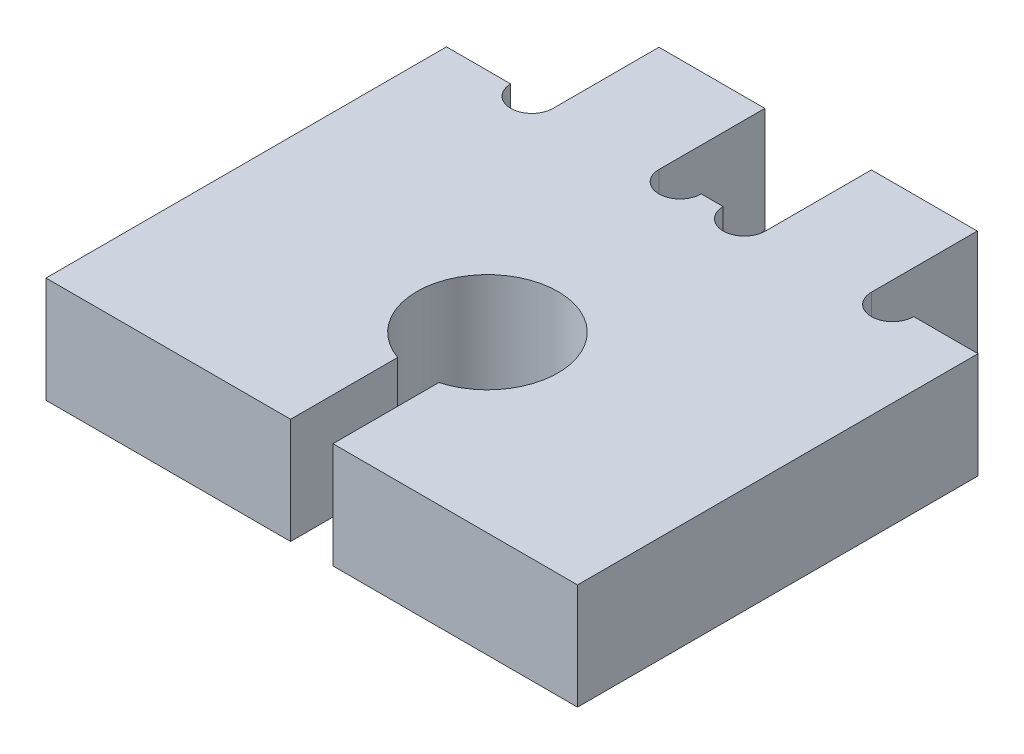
ISO-10303-21;
HEADER;
FILE_DESCRIPTION(('STEP AP214'),'2;1');
FILE_NAME('part.step','',(''),(''),'','','');
FILE_SCHEMA(('AUTOMOTIVE_DESIGN { 1 0 10303 214 1 1 1 1 }'));
ENDSEC;
DATA;
#1=APPLICATION_CONTEXT('core data for automotive mechanical design processes');
#2=APPLICATION_PROTOCOL_DEFINITION('international standard','automotive_design',2000,#1);
#3=PRODUCT_CONTEXT('',#1,'mechanical');
#4=PRODUCT('Part','Part','',(#3));
#5=PRODUCT_RELATED_PRODUCT_CATEGORY('part','',(#4));
#6=PRODUCT_DEFINITION_FORMATION('','',#4);
#7=PRODUCT_DEFINITION_CONTEXT('part definition',#1,'design');
#8=PRODUCT_DEFINITION('design','',#6,#7);
#9=PRODUCT_DEFINITION_SHAPE('','',#8);
#10=(LENGTH_UNIT() NAMED_UNIT(*) SI_UNIT(.MILLI.,.METRE.));
#11=(NAMED_UNIT(*) PLANE_ANGLE_UNIT() SI_UNIT($,.RADIAN.));
#12=(NAMED_UNIT(*) SI_UNIT($,.STERADIAN.) SOLID_ANGLE_UNIT());
#13=UNCERTAINTY_MEASURE_WITH_UNIT(LENGTH_MEASURE(1.E-05),#10,'distance_accuracy_value','');
#14=(GEOMETRIC_REPRESENTATION_CONTEXT(3) GLOBAL_UNCERTAINTY_ASSIGNED_CONTEXT((#13)) GLOBAL_UNIT_ASSIGNED_CONTEXT((#10,
#11,#12)) REPRESENTATION_CONTEXT('',''));
#15=CARTESIAN_POINT('',(0.,0.,0.));
#16=DIRECTION('',(0.,0.,1.));
#17=DIRECTION('',(1.,0.,0.));
#18=AXIS2_PLACEMENT_3D('',#15,#16,#17);
#19=CARTESIAN_POINT('',(34.65,15.,0.));
#20=DIRECTION('',(0.,0.,-1.));
#21=DIRECTION('',(-1.,0.,0.));
#22=AXIS2_PLACEMENT_3D('',#19,#20,#21);
#23=PLANE('',#22);
#24=DIRECTION('',(1.,0.,0.));
#25=VECTOR('',#24,1.);
#26=CARTESIAN_POINT('',(34.65,0.,0.));
#27=LINE('',#26,#25);
#28=CARTESIAN_POINT('',(0.,0.,0.));
#29=VERTEX_POINT('',#28);
#30=CARTESIAN_POINT('',(34.65,0.,0.));
#31=VERTEX_POINT('',#30);
#32=EDGE_CURVE('E201',#29,#31,#27,.T.);
#33=ORIENTED_EDGE('',*,*,#32,.T.);
#34=DIRECTION('',(0.,-1.,0.));
#35=VECTOR('',#34,1.);
#36=CARTESIAN_POINT('',(34.65,15.,0.));
#37=LINE('',#36,#35);
#38=CARTESIAN_POINT('',(34.65,15.,0.));
#39=VERTEX_POINT('',#38);
#40=EDGE_CURVE('E11',#39,#31,#37,.T.);
#41=ORIENTED_EDGE('',*,*,#40,.F.);
#42=DIRECTION('',(1.,0.,0.));
#43=VECTOR('',#42,1.);
#44=CARTESIAN_POINT('',(34.65,15.,0.));
#45=LINE('',#44,#43);
#46=CARTESIAN_POINT('',(0.,15.,0.));
#47=VERTEX_POINT('',#46);
#48=EDGE_CURVE('E239',#47,#39,#45,.T.);
#49=ORIENTED_EDGE('',*,*,#48,.F.);
#50=DIRECTION('',(0.,-1.,0.));
#51=VECTOR('',#50,1.);
#52=CARTESIAN_POINT('',(0.,15.,0.));
#53=LINE('',#52,#51);
#54=EDGE_CURVE('E197',#47,#29,#53,.T.);
#55=ORIENTED_EDGE('',*,*,#54,.T.);
#56=EDGE_LOOP('',(#33,#41,#49,#55));
#57=FACE_BOUND('',#56,.T.);
#58=ADVANCED_FACE('F33',(#57),#23,.F.);
#59=CARTESIAN_POINT('',(34.65,15.,-15.167182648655));
#60=DIRECTION('',(-1.,0.,0.));
#61=DIRECTION('',(0.,0.,1.));
#62=AXIS2_PLACEMENT_3D('',#59,#60,#61);
#63=PLANE('',#62);
#64=DIRECTION('',(0.,0.,-1.));
#65=VECTOR('',#64,1.);
#66=CARTESIAN_POINT('',(34.65,0.,-15.167182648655));
#67=LINE('',#66,#65);
#68=CARTESIAN_POINT('',(34.65,0.,-15.167182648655));
#69=VERTEX_POINT('',#68);
#70=EDGE_CURVE('E204',#31,#69,#67,.T.);
#71=ORIENTED_EDGE('',*,*,#70,.T.);
#72=DIRECTION('',(0.,-1.,0.));
#73=VECTOR('',#72,1.);
#74=CARTESIAN_POINT('',(34.65,15.,-15.167182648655));
#75=LINE('',#74,#73);
#76=CARTESIAN_POINT('',(34.65,15.,-15.167182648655));
#77=VERTEX_POINT('',#76);
#78=EDGE_CURVE('E41',#77,#69,#75,.T.);
#79=ORIENTED_EDGE('',*,*,#78,.F.);
#80=DIRECTION('',(0.,0.,-1.));
#81=VECTOR('',#80,1.);
#82=CARTESIAN_POINT('',(34.65,15.,-15.167182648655));
#83=LINE('',#82,#81);
#84=EDGE_CURVE('E128',#39,#77,#83,.T.);
#85=ORIENTED_EDGE('',*,*,#84,.F.);
#86=ORIENTED_EDGE('',*,*,#40,.T.);
#87=EDGE_LOOP('',(#71,#79,#85,#86));
#88=FACE_BOUND('',#87,.T.);
#89=ADVANCED_FACE('F357',(#88),#63,.F.);
#90=CARTESIAN_POINT('',(37.9156901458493,15.,-24.6189162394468));
#91=DIRECTION('',(0.,-1.,0.));
#92=DIRECTION('',(0.,0.,-1.));
#93=AXIS2_PLACEMENT_3D('',#90,#91,#92);
#94=CYLINDRICAL_SURFACE('',#93,10.);
#95=CARTESIAN_POINT('',(37.9156901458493,0.,-24.6189162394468));
#96=DIRECTION('',(0.,-1.,0.));
#97=DIRECTION('',(0.,0.,-1.));
#98=AXIS2_PLACEMENT_3D('',#95,#96,#97);
#99=CIRCLE('',#98,10.);
#100=CARTESIAN_POINT('',(40.65,0.,-15.));
#101=VERTEX_POINT('',#100);
#102=EDGE_CURVE('E206',#69,#101,#99,.T.);
#103=ORIENTED_EDGE('',*,*,#102,.T.);
#104=DIRECTION('',(0.,-1.,0.));
#105=VECTOR('',#104,1.);
#106=CARTESIAN_POINT('',(40.65,15.,-15.));
#107=LINE('',#106,#105);
#108=CARTESIAN_POINT('',(40.65,15.,-15.));
#109=VERTEX_POINT('',#108);
#110=EDGE_CURVE('E282',#109,#101,#107,.T.);
#111=ORIENTED_EDGE('',*,*,#110,.F.);
#112=CARTESIAN_POINT('',(37.9156901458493,15.,-24.6189162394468));
#113=DIRECTION('',(0.,-1.,0.));
#114=DIRECTION('',(0.,0.,-1.));
#115=AXIS2_PLACEMENT_3D('',#112,#113,#114);
#116=CIRCLE('',#115,10.);
#117=EDGE_CURVE('E290',#77,#109,#116,.T.);
#118=ORIENTED_EDGE('',*,*,#117,.F.);
#119=ORIENTED_EDGE('',*,*,#78,.T.);
#120=EDGE_LOOP('',(#103,#111,#118,#119));
#121=FACE_BOUND('',#120,.T.);
#122=ADVANCED_FACE('F288',(#121),#94,.F.);
#123=CARTESIAN_POINT('',(40.65,15.,0.));
#124=DIRECTION('',(1.,0.,0.));
#125=DIRECTION('',(0.,0.,-1.));
#126=AXIS2_PLACEMENT_3D('',#123,#124,#125);
#127=PLANE('',#126);
#128=DIRECTION('',(0.,0.,1.));
#129=VECTOR('',#128,1.);
#130=CARTESIAN_POINT('',(40.65,0.,0.));
#131=LINE('',#130,#129);
#132=CARTESIAN_POINT('',(40.65,0.,0.));
#133=VERTEX_POINT('',#132);
#134=EDGE_CURVE('E208',#101,#133,#131,.T.);
#135=ORIENTED_EDGE('',*,*,#134,.T.);
#136=DIRECTION('',(0.,-1.,0.));
#137=VECTOR('',#136,1.);
#138=CARTESIAN_POINT('',(40.65,15.,0.));
#139=LINE('',#138,#137);
#140=CARTESIAN_POINT('',(40.65,15.,0.));
#141=VERTEX_POINT('',#140);
#142=EDGE_CURVE('E279',#141,#133,#139,.T.);
#143=ORIENTED_EDGE('',*,*,#142,.F.);
#144=DIRECTION('',(0.,0.,1.));
#145=VECTOR('',#144,1.);
#146=CARTESIAN_POINT('',(40.65,15.,0.));
#147=LINE('',#146,#145);
#148=EDGE_CURVE('E308',#109,#141,#147,.T.);
#149=ORIENTED_EDGE('',*,*,#148,.F.);
#150=ORIENTED_EDGE('',*,*,#110,.T.);
#151=EDGE_LOOP('',(#135,#143,#149,#150));
#152=FACE_BOUND('',#151,.T.);
#153=ADVANCED_FACE('F299',(#152),#127,.F.);
#154=CARTESIAN_POINT('',(75.3,15.,0.));
#155=DIRECTION('',(0.,0.,-1.));
#156=DIRECTION('',(-1.,0.,0.));
#157=AXIS2_PLACEMENT_3D('',#154,#155,#156);
#158=PLANE('',#157);
#159=DIRECTION('',(1.,0.,0.));
#160=VECTOR('',#159,1.);
#161=CARTESIAN_POINT('',(75.3,0.,0.));
#162=LINE('',#161,#160);
#163=CARTESIAN_POINT('',(75.3,0.,0.));
#164=VERTEX_POINT('',#163);
#165=EDGE_CURVE('E210',#133,#164,#162,.T.);
#166=ORIENTED_EDGE('',*,*,#165,.T.);
#167=DIRECTION('',(0.,-1.,0.));
#168=VECTOR('',#167,1.);
#169=CARTESIAN_POINT('',(75.3,15.,0.));
#170=LINE('',#169,#168);
#171=CARTESIAN_POINT('',(75.3,15.,0.));
#172=VERTEX_POINT('',#171);
#173=EDGE_CURVE('E276',#172,#164,#170,.T.);
#174=ORIENTED_EDGE('',*,*,#173,.F.);
#175=DIRECTION('',(1.,0.,0.));
#176=VECTOR('',#175,1.);
#177=CARTESIAN_POINT('',(75.3,15.,0.));
#178=LINE('',#177,#176);
#179=EDGE_CURVE('E305',#141,#172,#178,.T.);
#180=ORIENTED_EDGE('',*,*,#179,.F.);
#181=ORIENTED_EDGE('',*,*,#142,.T.);
#182=EDGE_LOOP('',(#166,#174,#180,#181));
#183=FACE_BOUND('',#182,.T.);
#184=ADVANCED_FACE('F303',(#183),#158,.F.);
#185=CARTESIAN_POINT('',(75.3,15.,-56.7341882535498));
#186=DIRECTION('',(-1.,0.,0.));
#187=DIRECTION('',(0.,0.,1.));
#188=AXIS2_PLACEMENT_3D('',#185,#186,#187);
#189=PLANE('',#188);
#190=DIRECTION('',(0.,0.,-1.));
#191=VECTOR('',#190,1.);
#192=CARTESIAN_POINT('',(75.3,0.,-56.7341882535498));
#193=LINE('',#192,#191);
#194=CARTESIAN_POINT('',(75.3,0.,-56.7341882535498));
#195=VERTEX_POINT('',#194);
#196=EDGE_CURVE('E212',#164,#195,#193,.T.);
#197=ORIENTED_EDGE('',*,*,#196,.T.);
#198=DIRECTION('',(0.,-1.,0.));
#199=VECTOR('',#198,1.);
#200=CARTESIAN_POINT('',(75.3,15.,-56.7341882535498));
#201=LINE('',#200,#199);
#202=CARTESIAN_POINT('',(75.3,15.,-56.7341882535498));
#203=VERTEX_POINT('',#202);
#204=EDGE_CURVE('E273',#203,#195,#201,.T.);
#205=ORIENTED_EDGE('',*,*,#204,.F.);
#206=DIRECTION('',(0.,0.,-1.));
#207=VECTOR('',#206,1.);
#208=CARTESIAN_POINT('',(75.3,15.,-56.7341882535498));
#209=LINE('',#208,#207);
#210=EDGE_CURVE('E307',#172,#203,#209,.T.);
#211=ORIENTED_EDGE('',*,*,#210,.F.);
#212=ORIENTED_EDGE('',*,*,#173,.T.);
#213=EDGE_LOOP('',(#197,#205,#211,#212));
#214=FACE_BOUND('',#213,.T.);
#215=ADVANCED_FACE('F370',(#214),#189,.F.);
#216=CARTESIAN_POINT('',(66.2,15.,-56.7341882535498));
#217=DIRECTION('',(0.,0.,1.));
#218=DIRECTION('',(1.,0.,0.));
#219=AXIS2_PLACEMENT_3D('',#216,#217,#218);
#220=PLANE('',#219);
#221=DIRECTION('',(-1.,0.,0.));
#222=VECTOR('',#221,1.);
#223=CARTESIAN_POINT('',(66.2,0.,-56.7341882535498));
#224=LINE('',#223,#222);
#225=CARTESIAN_POINT('',(66.2,0.,-56.7341882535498));
#226=VERTEX_POINT('',#225);
#227=EDGE_CURVE('E214',#195,#226,#224,.T.);
#228=ORIENTED_EDGE('',*,*,#227,.T.);
#229=DIRECTION('',(0.,-1.,0.));
#230=VECTOR('',#229,1.);
#231=CARTESIAN_POINT('',(66.2,15.,-56.7341882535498));
#232=LINE('',#231,#230);
#233=CARTESIAN_POINT('',(66.2,15.,-56.7341882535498));
#234=VERTEX_POINT('',#233);
#235=EDGE_CURVE('E270',#234,#226,#232,.T.);
#236=ORIENTED_EDGE('',*,*,#235,.F.);
#237=DIRECTION('',(-1.,0.,0.));
#238=VECTOR('',#237,1.);
#239=CARTESIAN_POINT('',(66.2,15.,-56.7341882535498));
#240=LINE('',#239,#238);
#241=EDGE_CURVE('E310',#203,#234,#240,.T.);
#242=ORIENTED_EDGE('',*,*,#241,.F.);
#243=ORIENTED_EDGE('',*,*,#204,.T.);
#244=EDGE_LOOP('',(#228,#236,#242,#243));
#245=FACE_BOUND('',#244,.T.);
#246=ADVANCED_FACE('F373',(#245),#220,.F.);
#247=CARTESIAN_POINT('',(63.2,15.,-56.7341882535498));
#248=DIRECTION('',(0.,-1.,0.));
#249=DIRECTION('',(0.,0.,-1.));
#250=AXIS2_PLACEMENT_3D('',#247,#248,#249);
#251=CYLINDRICAL_SURFACE('',#250,3.);
#252=CARTESIAN_POINT('',(63.2,0.,-56.7341882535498));
#253=DIRECTION('',(0.,-1.,0.));
#254=DIRECTION('',(0.,0.,1.));
#255=AXIS2_PLACEMENT_3D('',#252,#253,#254);
#256=CIRCLE('',#255,3.);
#257=CARTESIAN_POINT('',(60.2,0.,-56.7341882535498));
#258=VERTEX_POINT('',#257);
#259=EDGE_CURVE('E216',#226,#258,#256,.T.);
#260=ORIENTED_EDGE('',*,*,#259,.T.);
#261=DIRECTION('',(0.,-1.,0.));
#262=VECTOR('',#261,1.);
#263=CARTESIAN_POINT('',(60.2,15.,-56.7341882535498));
#264=LINE('',#263,#262);
#265=CARTESIAN_POINT('',(60.2,15.,-56.7341882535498));
#266=VERTEX_POINT('',#265);
#267=EDGE_CURVE('E267',#266,#258,#264,.T.);
#268=ORIENTED_EDGE('',*,*,#267,.F.);
#269=CARTESIAN_POINT('',(63.2,15.,-56.7341882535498));
#270=DIRECTION('',(0.,-1.,0.));
#271=DIRECTION('',(0.,0.,1.));
#272=AXIS2_PLACEMENT_3D('',#269,#270,#271);
#273=CIRCLE('',#272,3.);
#274=EDGE_CURVE('E316',#234,#266,#273,.T.);
#275=ORIENTED_EDGE('',*,*,#274,.F.);
#276=ORIENTED_EDGE('',*,*,#235,.T.);
#277=EDGE_LOOP('',(#260,#268,#275,#276));
#278=FACE_BOUND('',#277,.T.);
#279=ADVANCED_FACE('F377',(#278),#251,.F.);
#280=CARTESIAN_POINT('',(60.2,15.,-71.7341882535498));
#281=DIRECTION('',(-1.,0.,0.));
#282=DIRECTION('',(0.,0.,1.));
#283=AXIS2_PLACEMENT_3D('',#280,#281,#282);
#284=PLANE('',#283);
#285=DIRECTION('',(0.,0.,-1.));
#286=VECTOR('',#285,1.);
#287=CARTESIAN_POINT('',(60.2,0.,-71.7341882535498));
#288=LINE('',#287,#286);
#289=CARTESIAN_POINT('',(60.2,0.,-71.7341882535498));
#290=VERTEX_POINT('',#289);
#291=EDGE_CURVE('E218',#258,#290,#288,.T.);
#292=ORIENTED_EDGE('',*,*,#291,.T.);
#293=DIRECTION('',(0.,-1.,0.));
#294=VECTOR('',#293,1.);
#295=CARTESIAN_POINT('',(60.2,15.,-71.7341882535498));
#296=LINE('',#295,#294);
#297=CARTESIAN_POINT('',(60.2,15.,-71.7341882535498));
#298=VERTEX_POINT('',#297);
#299=EDGE_CURVE('E264',#298,#290,#296,.T.);
#300=ORIENTED_EDGE('',*,*,#299,.F.);
#301=DIRECTION('',(0.,0.,-1.));
#302=VECTOR('',#301,1.);
#303=CARTESIAN_POINT('',(60.2,15.,-71.7341882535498));
#304=LINE('',#303,#302);
#305=EDGE_CURVE('E318',#266,#298,#304,.T.);
#306=ORIENTED_EDGE('',*,*,#305,.F.);
#307=ORIENTED_EDGE('',*,*,#267,.T.);
#308=EDGE_LOOP('',(#292,#300,#306,#307));
#309=FACE_BOUND('',#308,.T.);
#310=ADVANCED_FACE('F381',(#309),#284,.F.);
#311=CARTESIAN_POINT('',(45.2,15.,-71.7341882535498));
#312=DIRECTION('',(0.,0.,1.));
#313=DIRECTION('',(1.,0.,0.));
#314=AXIS2_PLACEMENT_3D('',#311,#312,#313);
#315=PLANE('',#314);
#316=DIRECTION('',(-1.,0.,0.));
#317=VECTOR('',#316,1.);
#318=CARTESIAN_POINT('',(45.2,0.,-71.7341882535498));
#319=LINE('',#318,#317);
#320=CARTESIAN_POINT('',(45.2,0.,-71.7341882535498));
#321=VERTEX_POINT('',#320);
#322=EDGE_CURVE('E220',#290,#321,#319,.T.);
#323=ORIENTED_EDGE('',*,*,#322,.T.);
#324=DIRECTION('',(0.,-1.,0.));
#325=VECTOR('',#324,1.);
#326=CARTESIAN_POINT('',(45.2,15.,-71.7341882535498));
#327=LINE('',#326,#325);
#328=CARTESIAN_POINT('',(45.2,15.,-71.7341882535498));
#329=VERTEX_POINT('',#328);
#330=EDGE_CURVE('E261',#329,#321,#327,.T.);
#331=ORIENTED_EDGE('',*,*,#330,.F.);
#332=DIRECTION('',(-1.,0.,0.));
#333=VECTOR('',#332,1.);
#334=CARTESIAN_POINT('',(45.2,15.,-71.7341882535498));
#335=LINE('',#334,#333);
#336=EDGE_CURVE('E320',#298,#329,#335,.T.);
#337=ORIENTED_EDGE('',*,*,#336,.F.);
#338=ORIENTED_EDGE('',*,*,#299,.T.);
#339=EDGE_LOOP('',(#323,#331,#337,#338));
#340=FACE_BOUND('',#339,.T.);
#341=ADVANCED_FACE('F385',(#340),#315,.F.);
#342=CARTESIAN_POINT('',(45.2,15.,-56.7341882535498));
#343=DIRECTION('',(1.,0.,0.));
#344=DIRECTION('',(0.,0.,-1.));
#345=AXIS2_PLACEMENT_3D('',#342,#343,#344);
#346=PLANE('',#345);
#347=DIRECTION('',(0.,0.,1.));
#348=VECTOR('',#347,1.);
#349=CARTESIAN_POINT('',(45.2,0.,-56.7341882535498));
#350=LINE('',#349,#348);
#351=CARTESIAN_POINT('',(45.2,0.,-56.7341882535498));
#352=VERTEX_POINT('',#351);
#353=EDGE_CURVE('E222',#321,#352,#350,.T.);
#354=ORIENTED_EDGE('',*,*,#353,.T.);
#355=DIRECTION('',(0.,-1.,0.));
#356=VECTOR('',#355,1.);
#357=CARTESIAN_POINT('',(45.2,15.,-56.7341882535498));
#358=LINE('',#357,#356);
#359=CARTESIAN_POINT('',(45.2,15.,-56.7341882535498));
#360=VERTEX_POINT('',#359);
#361=EDGE_CURVE('E258',#360,#352,#358,.T.);
#362=ORIENTED_EDGE('',*,*,#361,.F.);
#363=DIRECTION('',(0.,0.,1.));
#364=VECTOR('',#363,1.);
#365=CARTESIAN_POINT('',(45.2,15.,-56.7341882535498));
#366=LINE('',#365,#364);
#367=EDGE_CURVE('E322',#329,#360,#366,.T.);
#368=ORIENTED_EDGE('',*,*,#367,.F.);
#369=ORIENTED_EDGE('',*,*,#330,.T.);
#370=EDGE_LOOP('',(#354,#362,#368,#369));
#371=FACE_BOUND('',#370,.T.);
#372=ADVANCED_FACE('F389',(#371),#346,.F.);
#373=CARTESIAN_POINT('',(42.2,15.,-56.7341882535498));
#374=DIRECTION('',(0.,-1.,0.));
#375=DIRECTION('',(0.,0.,-1.));
#376=AXIS2_PLACEMENT_3D('',#373,#374,#375);
#377=CYLINDRICAL_SURFACE('',#376,3.);
#378=CARTESIAN_POINT('',(42.2,0.,-56.7341882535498));
#379=DIRECTION('',(0.,-1.,0.));
#380=DIRECTION('',(0.,0.,1.));
#381=AXIS2_PLACEMENT_3D('',#378,#379,#380);
#382=CIRCLE('',#381,3.);
#383=CARTESIAN_POINT('',(39.2,0.,-56.7341882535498));
#384=VERTEX_POINT('',#383);
#385=EDGE_CURVE('E224',#352,#384,#382,.T.);
#386=ORIENTED_EDGE('',*,*,#385,.T.);
#387=DIRECTION('',(0.,-1.,0.));
#388=VECTOR('',#387,1.);
#389=CARTESIAN_POINT('',(39.2,15.,-56.7341882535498));
#390=LINE('',#389,#388);
#391=CARTESIAN_POINT('',(39.2,15.,-56.7341882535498));
#392=VERTEX_POINT('',#391);
#393=EDGE_CURVE('E255',#392,#384,#390,.T.);
#394=ORIENTED_EDGE('',*,*,#393,.F.);
#395=CARTESIAN_POINT('',(42.2,15.,-56.7341882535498));
#396=DIRECTION('',(0.,-1.,0.));
#397=DIRECTION('',(0.,0.,1.));
#398=AXIS2_PLACEMENT_3D('',#395,#396,#397);
#399=CIRCLE('',#398,3.);
#400=EDGE_CURVE('E324',#360,#392,#399,.T.);
#401=ORIENTED_EDGE('',*,*,#400,.F.);
#402=ORIENTED_EDGE('',*,*,#361,.T.);
#403=EDGE_LOOP('',(#386,#394,#401,#402));
#404=FACE_BOUND('',#403,.T.);
#405=ADVANCED_FACE('F393',(#404),#377,.F.);
#406=CARTESIAN_POINT('',(36.1,15.,-56.7341882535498));
#407=DIRECTION('',(0.,0.,1.));
#408=DIRECTION('',(1.,0.,0.));
#409=AXIS2_PLACEMENT_3D('',#406,#407,#408);
#410=PLANE('',#409);
#411=DIRECTION('',(-1.,0.,0.));
#412=VECTOR('',#411,1.);
#413=CARTESIAN_POINT('',(36.1,0.,-56.7341882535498));
#414=LINE('',#413,#412);
#415=CARTESIAN_POINT('',(36.1,0.,-56.7341882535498));
#416=VERTEX_POINT('',#415);
#417=EDGE_CURVE('E226',#384,#416,#414,.T.);
#418=ORIENTED_EDGE('',*,*,#417,.T.);
#419=DIRECTION('',(0.,-1.,0.));
#420=VECTOR('',#419,1.);
#421=CARTESIAN_POINT('',(36.1,15.,-56.7341882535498));
#422=LINE('',#421,#420);
#423=CARTESIAN_POINT('',(36.1,15.,-56.7341882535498));
#424=VERTEX_POINT('',#423);
#425=EDGE_CURVE('E252',#424,#416,#422,.T.);
#426=ORIENTED_EDGE('',*,*,#425,.F.);
#427=DIRECTION('',(-1.,0.,0.));
#428=VECTOR('',#427,1.);
#429=CARTESIAN_POINT('',(36.1,15.,-56.7341882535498));
#430=LINE('',#429,#428);
#431=EDGE_CURVE('E326',#392,#424,#430,.T.);
#432=ORIENTED_EDGE('',*,*,#431,.F.);
#433=ORIENTED_EDGE('',*,*,#393,.T.);
#434=EDGE_LOOP('',(#418,#426,#432,#433));
#435=FACE_BOUND('',#434,.T.);
#436=ADVANCED_FACE('F397',(#435),#410,.F.);
#437=CARTESIAN_POINT('',(33.1,15.,-56.7341882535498));
#438=DIRECTION('',(0.,-1.,0.));
#439=DIRECTION('',(0.,0.,-1.));
#440=AXIS2_PLACEMENT_3D('',#437,#438,#439);
#441=CYLINDRICAL_SURFACE('',#440,3.00000000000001);
#442=CARTESIAN_POINT('',(33.1,0.,-56.7341882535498));
#443=DIRECTION('',(0.,-1.,0.));
#444=DIRECTION('',(0.,0.,1.));
#445=AXIS2_PLACEMENT_3D('',#442,#443,#444);
#446=CIRCLE('',#445,3.00000000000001);
#447=CARTESIAN_POINT('',(30.1,0.,-56.7341882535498));
#448=VERTEX_POINT('',#447);
#449=EDGE_CURVE('E228',#416,#448,#446,.T.);
#450=ORIENTED_EDGE('',*,*,#449,.T.);
#451=DIRECTION('',(0.,-1.,0.));
#452=VECTOR('',#451,1.);
#453=CARTESIAN_POINT('',(30.1,15.,-56.7341882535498));
#454=LINE('',#453,#452);
#455=CARTESIAN_POINT('',(30.1,15.,-56.7341882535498));
#456=VERTEX_POINT('',#455);
#457=EDGE_CURVE('E249',#456,#448,#454,.T.);
#458=ORIENTED_EDGE('',*,*,#457,.F.);
#459=CARTESIAN_POINT('',(33.1,15.,-56.7341882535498));
#460=DIRECTION('',(0.,-1.,0.));
#461=DIRECTION('',(0.,0.,1.));
#462=AXIS2_PLACEMENT_3D('',#459,#460,#461);
#463=CIRCLE('',#462,3.00000000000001);
#464=EDGE_CURVE('E328',#424,#456,#463,.T.);
#465=ORIENTED_EDGE('',*,*,#464,.F.);
#466=ORIENTED_EDGE('',*,*,#425,.T.);
#467=EDGE_LOOP('',(#450,#458,#465,#466));
#468=FACE_BOUND('',#467,.T.);
#469=ADVANCED_FACE('F401',(#468),#441,.F.);
#470=CARTESIAN_POINT('',(30.1,15.,-71.7341882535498));
#471=DIRECTION('',(-1.,0.,0.));
#472=DIRECTION('',(0.,0.,1.));
#473=AXIS2_PLACEMENT_3D('',#470,#471,#472);
#474=PLANE('',#473);
#475=DIRECTION('',(0.,0.,-1.));
#476=VECTOR('',#475,1.);
#477=CARTESIAN_POINT('',(30.1,0.,-71.7341882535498));
#478=LINE('',#477,#476);
#479=CARTESIAN_POINT('',(30.1,0.,-71.7341882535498));
#480=VERTEX_POINT('',#479);
#481=EDGE_CURVE('E230',#448,#480,#478,.T.);
#482=ORIENTED_EDGE('',*,*,#481,.T.);
#483=DIRECTION('',(0.,-1.,0.));
#484=VECTOR('',#483,1.);
#485=CARTESIAN_POINT('',(30.1,15.,-71.7341882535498));
#486=LINE('',#485,#484);
#487=CARTESIAN_POINT('',(30.1,15.,-71.7341882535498));
#488=VERTEX_POINT('',#487);
#489=EDGE_CURVE('E246',#488,#480,#486,.T.);
#490=ORIENTED_EDGE('',*,*,#489,.F.);
#491=DIRECTION('',(0.,0.,-1.));
#492=VECTOR('',#491,1.);
#493=CARTESIAN_POINT('',(30.1,15.,-71.7341882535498));
#494=LINE('',#493,#492);
#495=EDGE_CURVE('E330',#456,#488,#494,.T.);
#496=ORIENTED_EDGE('',*,*,#495,.F.);
#497=ORIENTED_EDGE('',*,*,#457,.T.);
#498=EDGE_LOOP('',(#482,#490,#496,#497));
#499=FACE_BOUND('',#498,.T.);
#500=ADVANCED_FACE('F405',(#499),#474,.F.);
#501=CARTESIAN_POINT('',(15.1,15.,-71.7341882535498));
#502=DIRECTION('',(0.,0.,1.));
#503=DIRECTION('',(1.,0.,0.));
#504=AXIS2_PLACEMENT_3D('',#501,#502,#503);
#505=PLANE('',#504);
#506=DIRECTION('',(-1.,0.,0.));
#507=VECTOR('',#506,1.);
#508=CARTESIAN_POINT('',(15.1,0.,-71.7341882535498));
#509=LINE('',#508,#507);
#510=CARTESIAN_POINT('',(15.1,0.,-71.7341882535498));
#511=VERTEX_POINT('',#510);
#512=EDGE_CURVE('E232',#480,#511,#509,.T.);
#513=ORIENTED_EDGE('',*,*,#512,.T.);
#514=DIRECTION('',(0.,-1.,0.));
#515=VECTOR('',#514,1.);
#516=CARTESIAN_POINT('',(15.1,15.,-71.7341882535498));
#517=LINE('',#516,#515);
#518=CARTESIAN_POINT('',(15.1,15.,-71.7341882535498));
#519=VERTEX_POINT('',#518);
#520=EDGE_CURVE('E243',#519,#511,#517,.T.);
#521=ORIENTED_EDGE('',*,*,#520,.F.);
#522=DIRECTION('',(-1.,0.,0.));
#523=VECTOR('',#522,1.);
#524=CARTESIAN_POINT('',(15.1,15.,-71.7341882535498));
#525=LINE('',#524,#523);
#526=EDGE_CURVE('E332',#488,#519,#525,.T.);
#527=ORIENTED_EDGE('',*,*,#526,.F.);
#528=ORIENTED_EDGE('',*,*,#489,.T.);
#529=EDGE_LOOP('',(#513,#521,#527,#528));
#530=FACE_BOUND('',#529,.T.);
#531=ADVANCED_FACE('F338',(#530),#505,.F.);
#532=CARTESIAN_POINT('',(15.1,15.,-56.7341882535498));
#533=DIRECTION('',(1.,0.,0.));
#534=DIRECTION('',(0.,0.,-1.));
#535=AXIS2_PLACEMENT_3D('',#532,#533,#534);
#536=PLANE('',#535);
#537=DIRECTION('',(0.,0.,1.));
#538=VECTOR('',#537,1.);
#539=CARTESIAN_POINT('',(15.1,0.,-56.7341882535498));
#540=LINE('',#539,#538);
#541=CARTESIAN_POINT('',(15.1,0.,-56.7341882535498));
#542=VERTEX_POINT('',#541);
#543=EDGE_CURVE('E234',#511,#542,#540,.T.);
#544=ORIENTED_EDGE('',*,*,#543,.T.);
#545=DIRECTION('',(0.,-1.,0.));
#546=VECTOR('',#545,1.);
#547=CARTESIAN_POINT('',(15.1,15.,-56.7341882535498));
#548=LINE('',#547,#546);
#549=CARTESIAN_POINT('',(15.1,15.,-56.7341882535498));
#550=VERTEX_POINT('',#549);
#551=EDGE_CURVE('E192',#550,#542,#548,.T.);
#552=ORIENTED_EDGE('',*,*,#551,.F.);
#553=DIRECTION('',(0.,0.,1.));
#554=VECTOR('',#553,1.);
#555=CARTESIAN_POINT('',(15.1,15.,-56.7341882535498));
#556=LINE('',#555,#554);
#557=EDGE_CURVE('E183',#519,#550,#556,.T.);
#558=ORIENTED_EDGE('',*,*,#557,.F.);
#559=ORIENTED_EDGE('',*,*,#520,.T.);
#560=EDGE_LOOP('',(#544,#552,#558,#559));
#561=FACE_BOUND('',#560,.T.);
#562=ADVANCED_FACE('F342',(#561),#536,.F.);
#563=CARTESIAN_POINT('',(12.1,15.,-56.7341882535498));
#564=DIRECTION('',(0.,-1.,0.));
#565=DIRECTION('',(0.,0.,-1.));
#566=AXIS2_PLACEMENT_3D('',#563,#564,#565);
#567=CYLINDRICAL_SURFACE('',#566,3.);
#568=CARTESIAN_POINT('',(12.1,0.,-56.7341882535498));
#569=DIRECTION('',(0.,-1.,0.));
#570=DIRECTION('',(0.,0.,1.));
#571=AXIS2_PLACEMENT_3D('',#568,#569,#570);
#572=CIRCLE('',#571,3.);
#573=CARTESIAN_POINT('',(9.1,0.,-56.7341882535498));
#574=VERTEX_POINT('',#573);
#575=EDGE_CURVE('E191',#542,#574,#572,.T.);
#576=ORIENTED_EDGE('',*,*,#575,.T.);
#577=DIRECTION('',(0.,-1.,0.));
#578=VECTOR('',#577,1.);
#579=CARTESIAN_POINT('',(9.1,15.,-56.7341882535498));
#580=LINE('',#579,#578);
#581=CARTESIAN_POINT('',(9.1,15.,-56.7341882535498));
#582=VERTEX_POINT('',#581);
#583=EDGE_CURVE('E188',#582,#574,#580,.T.);
#584=ORIENTED_EDGE('',*,*,#583,.F.);
#585=CARTESIAN_POINT('',(12.1,15.,-56.7341882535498));
#586=DIRECTION('',(0.,-1.,0.));
#587=DIRECTION('',(0.,0.,1.));
#588=AXIS2_PLACEMENT_3D('',#585,#586,#587);
#589=CIRCLE('',#588,3.);
#590=EDGE_CURVE('E177',#550,#582,#589,.T.);
#591=ORIENTED_EDGE('',*,*,#590,.F.);
#592=ORIENTED_EDGE('',*,*,#551,.T.);
#593=EDGE_LOOP('',(#576,#584,#591,#592));
#594=FACE_BOUND('',#593,.T.);
#595=ADVANCED_FACE('F189',(#594),#567,.F.);
#596=CARTESIAN_POINT('',(0.,15.,-56.7341882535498));
#597=DIRECTION('',(0.,0.,1.));
#598=DIRECTION('',(1.,0.,0.));
#599=AXIS2_PLACEMENT_3D('',#596,#597,#598);
#600=PLANE('',#599);
#601=DIRECTION('',(-1.,0.,0.));
#602=VECTOR('',#601,1.);
#603=CARTESIAN_POINT('',(0.,0.,-56.7341882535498));
#604=LINE('',#603,#602);
#605=CARTESIAN_POINT('',(0.,0.,-56.7341882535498));
#606=VERTEX_POINT('',#605);
#607=EDGE_CURVE('E114',#574,#606,#604,.T.);
#608=ORIENTED_EDGE('',*,*,#607,.T.);
#609=DIRECTION('',(0.,-1.,0.));
#610=VECTOR('',#609,1.);
#611=CARTESIAN_POINT('',(0.,15.,-56.7341882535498));
#612=LINE('',#611,#610);
#613=CARTESIAN_POINT('',(0.,15.,-56.7341882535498));
#614=VERTEX_POINT('',#613);
#615=EDGE_CURVE('E193',#614,#606,#612,.T.);
#616=ORIENTED_EDGE('',*,*,#615,.F.);
#617=DIRECTION('',(-1.,0.,0.));
#618=VECTOR('',#617,1.);
#619=CARTESIAN_POINT('',(0.,15.,-56.7341882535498));
#620=LINE('',#619,#618);
#621=EDGE_CURVE('E181',#582,#614,#620,.T.);
#622=ORIENTED_EDGE('',*,*,#621,.F.);
#623=ORIENTED_EDGE('',*,*,#583,.T.);
#624=EDGE_LOOP('',(#608,#616,#622,#623));
#625=FACE_BOUND('',#624,.T.);
#626=ADVANCED_FACE('F195',(#625),#600,.F.);
#627=CARTESIAN_POINT('',(0.,15.,0.));
#628=DIRECTION('',(1.,0.,0.));
#629=DIRECTION('',(0.,0.,-1.));
#630=AXIS2_PLACEMENT_3D('',#627,#628,#629);
#631=PLANE('',#630);
#632=DIRECTION('',(0.,0.,1.));
#633=VECTOR('',#632,1.);
#634=CARTESIAN_POINT('',(0.,0.,0.));
#635=LINE('',#634,#633);
#636=EDGE_CURVE('E120',#606,#29,#635,.T.);
#637=ORIENTED_EDGE('',*,*,#636,.T.);
#638=ORIENTED_EDGE('',*,*,#54,.F.);
#639=DIRECTION('',(0.,0.,1.));
#640=VECTOR('',#639,1.);
#641=CARTESIAN_POINT('',(0.,15.,0.));
#642=LINE('',#641,#640);
#643=EDGE_CURVE('E49',#614,#47,#642,.T.);
#644=ORIENTED_EDGE('',*,*,#643,.F.);
#645=ORIENTED_EDGE('',*,*,#615,.T.);
#646=EDGE_LOOP('',(#637,#638,#644,#645));
#647=FACE_BOUND('',#646,.T.);
#648=ADVANCED_FACE('F346',(#647),#631,.F.);
#649=CARTESIAN_POINT('',(12.1,15.,-56.7341882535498));
#650=DIRECTION('',(0.,1.,0.));
#651=DIRECTION('',(0.,0.,1.));
#652=AXIS2_PLACEMENT_3D('',#649,#650,#651);
#653=PLANE('',#652);
#654=ORIENTED_EDGE('',*,*,#48,.T.);
#655=ORIENTED_EDGE('',*,*,#84,.T.);
#656=ORIENTED_EDGE('',*,*,#117,.T.);
#657=ORIENTED_EDGE('',*,*,#148,.T.);
#658=ORIENTED_EDGE('',*,*,#179,.T.);
#659=ORIENTED_EDGE('',*,*,#210,.T.);
#660=ORIENTED_EDGE('',*,*,#241,.T.);
#661=ORIENTED_EDGE('',*,*,#274,.T.);
#662=ORIENTED_EDGE('',*,*,#305,.T.);
#663=ORIENTED_EDGE('',*,*,#336,.T.);
#664=ORIENTED_EDGE('',*,*,#367,.T.);
#665=ORIENTED_EDGE('',*,*,#400,.T.);
#666=ORIENTED_EDGE('',*,*,#431,.T.);
#667=ORIENTED_EDGE('',*,*,#464,.T.);
#668=ORIENTED_EDGE('',*,*,#495,.T.);
#669=ORIENTED_EDGE('',*,*,#526,.T.);
#670=ORIENTED_EDGE('',*,*,#557,.T.);
#671=ORIENTED_EDGE('',*,*,#590,.T.);
#672=ORIENTED_EDGE('',*,*,#621,.T.);
#673=ORIENTED_EDGE('',*,*,#643,.T.);
#674=EDGE_LOOP('',(#654,#655,#656,#657,#658,#659,#660,#661,#662,#663,#664,#665,#666,#667,#668,
#669,#670,#671,#672,#673));
#675=FACE_BOUND('',#674,.T.);
#676=ADVANCED_FACE('F179',(#675),#653,.T.);
#677=CARTESIAN_POINT('',(12.1,0.,-56.7341882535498));
#678=DIRECTION('',(0.,1.,0.));
#679=DIRECTION('',(0.,0.,1.));
#680=AXIS2_PLACEMENT_3D('',#677,#678,#679);
#681=PLANE('',#680);
#682=ORIENTED_EDGE('',*,*,#32,.F.);
#683=ORIENTED_EDGE('',*,*,#636,.F.);
#684=ORIENTED_EDGE('',*,*,#607,.F.);
#685=ORIENTED_EDGE('',*,*,#575,.F.);
#686=ORIENTED_EDGE('',*,*,#543,.F.);
#687=ORIENTED_EDGE('',*,*,#512,.F.);
#688=ORIENTED_EDGE('',*,*,#481,.F.);
#689=ORIENTED_EDGE('',*,*,#449,.F.);
#690=ORIENTED_EDGE('',*,*,#417,.F.);
#691=ORIENTED_EDGE('',*,*,#385,.F.);
#692=ORIENTED_EDGE('',*,*,#353,.F.);
#693=ORIENTED_EDGE('',*,*,#322,.F.);
#694=ORIENTED_EDGE('',*,*,#291,.F.);
#695=ORIENTED_EDGE('',*,*,#259,.F.);
#696=ORIENTED_EDGE('',*,*,#227,.F.);
#697=ORIENTED_EDGE('',*,*,#196,.F.);
#698=ORIENTED_EDGE('',*,*,#165,.F.);
#699=ORIENTED_EDGE('',*,*,#134,.F.);
#700=ORIENTED_EDGE('',*,*,#102,.F.);
#701=ORIENTED_EDGE('',*,*,#70,.F.);
#702=EDGE_LOOP('',(#682,#683,#684,#685,#686,#687,#688,#689,#690,#691,#692,#693,#694,#695,#696,
#697,#698,#699,#700,#701));
#703=FACE_BOUND('',#702,.T.);
#704=ADVANCED_FACE('F294',(#703),#681,.F.);
#705=CLOSED_SHELL('',(#58,#89,#122,#153,#184,#215,#246,#279,#310,#341,#372,#405,#436,#469,#500,
#531,#562,#595,#626,#648,#676,#704));
#706=MANIFOLD_SOLID_BREP('B2',#705);
#707=ADVANCED_BREP_SHAPE_REPRESENTATION('',(#18,#706),#14);
#708=SHAPE_DEFINITION_REPRESENTATION(#9,#707);
ENDSEC;
END-ISO-10303-21;
